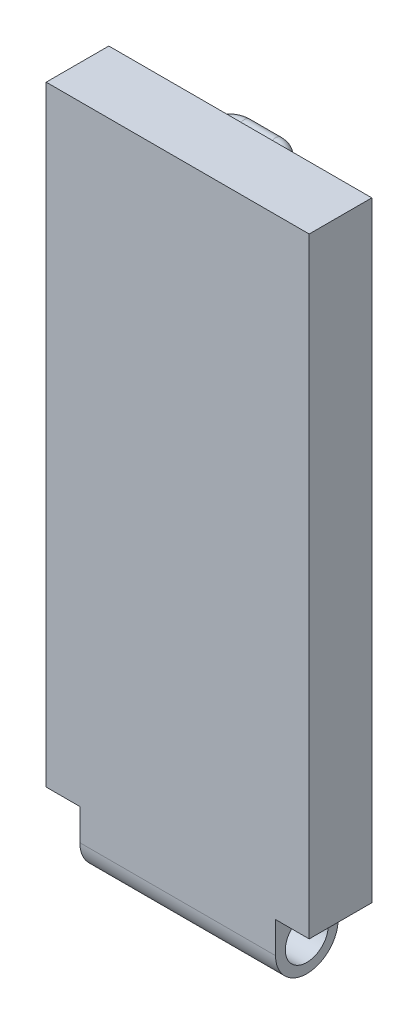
ISO-10303-21;
HEADER;
FILE_DESCRIPTION(('STEP AP214'),'2;1');
FILE_NAME('part.step','',(''),(''),'','','');
FILE_SCHEMA(('AUTOMOTIVE_DESIGN { 1 0 10303 214 1 1 1 1 }'));
ENDSEC;
DATA;
#1=APPLICATION_CONTEXT('core data for automotive mechanical design processes');
#2=APPLICATION_PROTOCOL_DEFINITION('international standard','automotive_design',2000,#1);
#3=PRODUCT_CONTEXT('',#1,'mechanical');
#4=PRODUCT('Part','Part','',(#3));
#5=PRODUCT_RELATED_PRODUCT_CATEGORY('part','',(#4));
#6=PRODUCT_DEFINITION_FORMATION('','',#4);
#7=PRODUCT_DEFINITION_CONTEXT('part definition',#1,'design');
#8=PRODUCT_DEFINITION('design','',#6,#7);
#9=PRODUCT_DEFINITION_SHAPE('','',#8);
#10=(LENGTH_UNIT() NAMED_UNIT(*) SI_UNIT(.MILLI.,.METRE.));
#11=(NAMED_UNIT(*) PLANE_ANGLE_UNIT() SI_UNIT($,.RADIAN.));
#12=(NAMED_UNIT(*) SI_UNIT($,.STERADIAN.) SOLID_ANGLE_UNIT());
#13=UNCERTAINTY_MEASURE_WITH_UNIT(LENGTH_MEASURE(1.E-05),#10,'distance_accuracy_value','');
#14=(GEOMETRIC_REPRESENTATION_CONTEXT(3) GLOBAL_UNCERTAINTY_ASSIGNED_CONTEXT((#13)) GLOBAL_UNIT_ASSIGNED_CONTEXT((#10,
#11,#12)) REPRESENTATION_CONTEXT('',''));
#15=CARTESIAN_POINT('',(0.,0.,0.));
#16=DIRECTION('',(0.,0.,1.));
#17=DIRECTION('',(1.,0.,0.));
#18=AXIS2_PLACEMENT_3D('',#15,#16,#17);
#19=CARTESIAN_POINT('',(0.,0.,-8.));
#20=DIRECTION('',(0.,0.,-1.));
#21=DIRECTION('',(-1.,0.,0.));
#22=AXIS2_PLACEMENT_3D('',#19,#20,#21);
#23=PLANE('',#22);
#24=CARTESIAN_POINT('',(12.8,75.,-8.));
#25=DIRECTION('',(0.,0.,-1.));
#26=DIRECTION('',(-1.,0.,0.));
#27=AXIS2_PLACEMENT_3D('',#24,#25,#26);
#28=CIRCLE('',#27,1.);
#29=CARTESIAN_POINT('',(11.8,75.,-8.));
#30=VERTEX_POINT('',#29);
#31=CARTESIAN_POINT('',(13.8,75.,-8.));
#32=VERTEX_POINT('',#31);
#33=EDGE_CURVE('E60',#30,#32,#28,.T.);
#34=ORIENTED_EDGE('',*,*,#33,.F.);
#35=DIRECTION('',(0.,1.,0.));
#36=VECTOR('',#35,1.);
#37=CARTESIAN_POINT('',(11.8,75.,-8.));
#38=LINE('',#37,#36);
#39=CARTESIAN_POINT('',(11.8,73.,-8.));
#40=VERTEX_POINT('',#39);
#41=EDGE_CURVE('E197',#40,#30,#38,.T.);
#42=ORIENTED_EDGE('',*,*,#41,.F.);
#43=CARTESIAN_POINT('',(12.8,73.,-8.));
#44=DIRECTION('',(0.,0.,-1.));
#45=DIRECTION('',(-1.,0.,0.));
#46=AXIS2_PLACEMENT_3D('',#43,#44,#45);
#47=CIRCLE('',#46,1.);
#48=CARTESIAN_POINT('',(13.8,73.,-8.));
#49=VERTEX_POINT('',#48);
#50=EDGE_CURVE('E695',#49,#40,#47,.T.);
#51=ORIENTED_EDGE('',*,*,#50,.F.);
#52=DIRECTION('',(0.,-1.,0.));
#53=VECTOR('',#52,1.);
#54=CARTESIAN_POINT('',(13.8,75.,-8.));
#55=LINE('',#54,#53);
#56=EDGE_CURVE('E702',#32,#49,#55,.T.);
#57=ORIENTED_EDGE('',*,*,#56,.F.);
#58=EDGE_LOOP('',(#34,#42,#51,#57));
#59=FACE_BOUND('',#58,.T.);
#60=DIRECTION('',(0.,-1.,0.));
#61=VECTOR('',#60,1.);
#62=CARTESIAN_POINT('',(0.,0.,-8.));
#63=LINE('',#62,#61);
#64=CARTESIAN_POINT('',(0.,78.,-8.));
#65=VERTEX_POINT('',#64);
#66=CARTESIAN_POINT('',(0.,0.,-8.));
#67=VERTEX_POINT('',#66);
#68=EDGE_CURVE('E344',#65,#67,#63,.T.);
#69=ORIENTED_EDGE('',*,*,#68,.F.);
#70=DIRECTION('',(-1.,0.,0.));
#71=VECTOR('',#70,1.);
#72=CARTESIAN_POINT('',(0.,78.,-8.));
#73=LINE('',#72,#71);
#74=CARTESIAN_POINT('',(33.6,78.,-8.));
#75=VERTEX_POINT('',#74);
#76=EDGE_CURVE('E372',#75,#65,#73,.T.);
#77=ORIENTED_EDGE('',*,*,#76,.F.);
#78=DIRECTION('',(0.,1.,0.));
#79=VECTOR('',#78,1.);
#80=CARTESIAN_POINT('',(33.6,0.,-8.));
#81=LINE('',#80,#79);
#82=CARTESIAN_POINT('',(33.6,0.,-8.));
#83=VERTEX_POINT('',#82);
#84=EDGE_CURVE('E349',#83,#75,#81,.T.);
#85=ORIENTED_EDGE('',*,*,#84,.F.);
#86=DIRECTION('',(1.,0.,0.));
#87=VECTOR('',#86,1.);
#88=CARTESIAN_POINT('',(0.,0.,-8.));
#89=LINE('',#88,#87);
#90=CARTESIAN_POINT('',(29.3,0.,-8.));
#91=VERTEX_POINT('',#90);
#92=EDGE_CURVE('E319',#91,#83,#89,.T.);
#93=ORIENTED_EDGE('',*,*,#92,.F.);
#94=DIRECTION('',(0.,-1.,0.));
#95=VECTOR('',#94,1.);
#96=CARTESIAN_POINT('',(29.3,0.,-8.));
#97=LINE('',#96,#95);
#98=CARTESIAN_POINT('',(29.3,-4.,-8.));
#99=VERTEX_POINT('',#98);
#100=EDGE_CURVE('E302',#91,#99,#97,.T.);
#101=ORIENTED_EDGE('',*,*,#100,.T.);
#102=DIRECTION('',(1.,0.,0.));
#103=VECTOR('',#102,1.);
#104=CARTESIAN_POINT('',(4.3,-4.,-8.));
#105=LINE('',#104,#103);
#106=CARTESIAN_POINT('',(4.3,-4.,-8.));
#107=VERTEX_POINT('',#106);
#108=EDGE_CURVE('E340',#107,#99,#105,.T.);
#109=ORIENTED_EDGE('',*,*,#108,.F.);
#110=DIRECTION('',(0.,-1.,0.));
#111=VECTOR('',#110,1.);
#112=CARTESIAN_POINT('',(4.3,0.,-8.));
#113=LINE('',#112,#111);
#114=CARTESIAN_POINT('',(4.3,0.,-8.));
#115=VERTEX_POINT('',#114);
#116=EDGE_CURVE('E308',#115,#107,#113,.T.);
#117=ORIENTED_EDGE('',*,*,#116,.F.);
#118=EDGE_CURVE('E352',#67,#115,#89,.T.);
#119=ORIENTED_EDGE('',*,*,#118,.F.);
#120=EDGE_LOOP('',(#69,#77,#85,#93,#101,#109,#117,#119));
#121=FACE_BOUND('',#120,.T.);
#122=DIRECTION('',(0.,1.,0.));
#123=VECTOR('',#122,1.);
#124=CARTESIAN_POINT('',(21.8,75.,-8.));
#125=LINE('',#124,#123);
#126=CARTESIAN_POINT('',(21.8,73.,-8.));
#127=VERTEX_POINT('',#126);
#128=CARTESIAN_POINT('',(21.8,75.,-8.));
#129=VERTEX_POINT('',#128);
#130=EDGE_CURVE('E279',#127,#129,#125,.T.);
#131=ORIENTED_EDGE('',*,*,#130,.T.);
#132=CARTESIAN_POINT('',(20.8,75.,-8.));
#133=DIRECTION('',(0.,0.,1.));
#134=DIRECTION('',(1.,0.,0.));
#135=AXIS2_PLACEMENT_3D('',#132,#133,#134);
#136=CIRCLE('',#135,1.);
#137=CARTESIAN_POINT('',(19.8,75.,-8.));
#138=VERTEX_POINT('',#137);
#139=EDGE_CURVE('E276',#129,#138,#136,.T.);
#140=ORIENTED_EDGE('',*,*,#139,.T.);
#141=DIRECTION('',(0.,-1.,0.));
#142=VECTOR('',#141,1.);
#143=CARTESIAN_POINT('',(19.8,75.,-8.));
#144=LINE('',#143,#142);
#145=CARTESIAN_POINT('',(19.8,73.,-8.));
#146=VERTEX_POINT('',#145);
#147=EDGE_CURVE('E285',#138,#146,#144,.T.);
#148=ORIENTED_EDGE('',*,*,#147,.T.);
#149=CARTESIAN_POINT('',(20.8,73.,-8.));
#150=DIRECTION('',(0.,0.,1.));
#151=DIRECTION('',(1.,0.,0.));
#152=AXIS2_PLACEMENT_3D('',#149,#150,#151);
#153=CIRCLE('',#152,1.);
#154=EDGE_CURVE('E282',#146,#127,#153,.T.);
#155=ORIENTED_EDGE('',*,*,#154,.T.);
#156=EDGE_LOOP('',(#131,#140,#148,#155));
#157=FACE_BOUND('',#156,.T.);
#158=ADVANCED_FACE('F35',(#59,#121,#157),#23,.T.);
#159=CARTESIAN_POINT('',(0.,0.,-8.));
#160=DIRECTION('',(0.,-1.,0.));
#161=DIRECTION('',(0.,0.,-1.));
#162=AXIS2_PLACEMENT_3D('',#159,#160,#161);
#163=PLANE('',#162);
#164=DIRECTION('',(1.,0.,0.));
#165=VECTOR('',#164,1.);
#166=CARTESIAN_POINT('',(0.,0.,0.));
#167=LINE('',#166,#165);
#168=CARTESIAN_POINT('',(29.3,0.,0.));
#169=VERTEX_POINT('',#168);
#170=CARTESIAN_POINT('',(33.6,0.,0.));
#171=VERTEX_POINT('',#170);
#172=EDGE_CURVE('E354',#169,#171,#167,.T.);
#173=ORIENTED_EDGE('',*,*,#172,.F.);
#174=DIRECTION('',(0.,0.,-1.));
#175=VECTOR('',#174,1.);
#176=CARTESIAN_POINT('',(29.3,0.,-8.));
#177=LINE('',#176,#175);
#178=EDGE_CURVE('E324',#169,#91,#177,.T.);
#179=ORIENTED_EDGE('',*,*,#178,.T.);
#180=ORIENTED_EDGE('',*,*,#92,.T.);
#181=DIRECTION('',(0.,0.,1.));
#182=VECTOR('',#181,1.);
#183=CARTESIAN_POINT('',(33.6,0.,-8.));
#184=LINE('',#183,#182);
#185=EDGE_CURVE('E369',#83,#171,#184,.T.);
#186=ORIENTED_EDGE('',*,*,#185,.T.);
#187=EDGE_LOOP('',(#173,#179,#180,#186));
#188=FACE_BOUND('',#187,.T.);
#189=ADVANCED_FACE('F400',(#188),#163,.T.);
#190=CARTESIAN_POINT('',(0.,0.,-8.));
#191=DIRECTION('',(-1.,0.,0.));
#192=DIRECTION('',(0.,0.,1.));
#193=AXIS2_PLACEMENT_3D('',#190,#191,#192);
#194=PLANE('',#193);
#195=DIRECTION('',(0.,-1.,0.));
#196=VECTOR('',#195,1.);
#197=CARTESIAN_POINT('',(0.,0.,0.));
#198=LINE('',#197,#196);
#199=CARTESIAN_POINT('',(0.,78.,0.));
#200=VERTEX_POINT('',#199);
#201=CARTESIAN_POINT('',(0.,0.,0.));
#202=VERTEX_POINT('',#201);
#203=EDGE_CURVE('E343',#200,#202,#198,.T.);
#204=ORIENTED_EDGE('',*,*,#203,.F.);
#205=DIRECTION('',(0.,0.,1.));
#206=VECTOR('',#205,1.);
#207=CARTESIAN_POINT('',(0.,78.,-8.));
#208=LINE('',#207,#206);
#209=EDGE_CURVE('E11',#65,#200,#208,.T.);
#210=ORIENTED_EDGE('',*,*,#209,.F.);
#211=ORIENTED_EDGE('',*,*,#68,.T.);
#212=DIRECTION('',(0.,0.,1.));
#213=VECTOR('',#212,1.);
#214=CARTESIAN_POINT('',(0.,0.,-8.));
#215=LINE('',#214,#213);
#216=EDGE_CURVE('E371',#67,#202,#215,.T.);
#217=ORIENTED_EDGE('',*,*,#216,.T.);
#218=EDGE_LOOP('',(#204,#210,#211,#217));
#219=FACE_BOUND('',#218,.T.);
#220=ADVANCED_FACE('F37',(#219),#194,.T.);
#221=CARTESIAN_POINT('',(0.,78.,-8.));
#222=DIRECTION('',(0.,1.,0.));
#223=DIRECTION('',(0.,0.,1.));
#224=AXIS2_PLACEMENT_3D('',#221,#222,#223);
#225=PLANE('',#224);
#226=DIRECTION('',(-1.,0.,0.));
#227=VECTOR('',#226,1.);
#228=CARTESIAN_POINT('',(0.,78.,0.));
#229=LINE('',#228,#227);
#230=CARTESIAN_POINT('',(33.6,78.,0.));
#231=VERTEX_POINT('',#230);
#232=EDGE_CURVE('E346',#231,#200,#229,.T.);
#233=ORIENTED_EDGE('',*,*,#232,.F.);
#234=DIRECTION('',(0.,0.,1.));
#235=VECTOR('',#234,1.);
#236=CARTESIAN_POINT('',(33.6,78.,-8.));
#237=LINE('',#236,#235);
#238=EDGE_CURVE('E44',#75,#231,#237,.T.);
#239=ORIENTED_EDGE('',*,*,#238,.F.);
#240=ORIENTED_EDGE('',*,*,#76,.T.);
#241=ORIENTED_EDGE('',*,*,#209,.T.);
#242=EDGE_LOOP('',(#233,#239,#240,#241));
#243=FACE_BOUND('',#242,.T.);
#244=ADVANCED_FACE('F393',(#243),#225,.T.);
#245=CARTESIAN_POINT('',(33.6,0.,-8.));
#246=DIRECTION('',(1.,0.,0.));
#247=DIRECTION('',(0.,0.,-1.));
#248=AXIS2_PLACEMENT_3D('',#245,#246,#247);
#249=PLANE('',#248);
#250=DIRECTION('',(0.,1.,0.));
#251=VECTOR('',#250,1.);
#252=CARTESIAN_POINT('',(33.6,0.,0.));
#253=LINE('',#252,#251);
#254=EDGE_CURVE('E362',#171,#231,#253,.T.);
#255=ORIENTED_EDGE('',*,*,#254,.F.);
#256=ORIENTED_EDGE('',*,*,#185,.F.);
#257=ORIENTED_EDGE('',*,*,#84,.T.);
#258=ORIENTED_EDGE('',*,*,#238,.T.);
#259=EDGE_LOOP('',(#255,#256,#257,#258));
#260=FACE_BOUND('',#259,.T.);
#261=ADVANCED_FACE('F384',(#260),#249,.T.);
#262=DIRECTION('',(0.,0.,-1.));
#263=VECTOR('',#262,1.);
#264=CARTESIAN_POINT('',(4.3,0.,-8.));
#265=LINE('',#264,#263);
#266=CARTESIAN_POINT('',(4.3,0.,0.));
#267=VERTEX_POINT('',#266);
#268=EDGE_CURVE('E314',#267,#115,#265,.T.);
#269=ORIENTED_EDGE('',*,*,#268,.F.);
#270=EDGE_CURVE('E357',#202,#267,#167,.T.);
#271=ORIENTED_EDGE('',*,*,#270,.F.);
#272=ORIENTED_EDGE('',*,*,#216,.F.);
#273=ORIENTED_EDGE('',*,*,#118,.T.);
#274=EDGE_LOOP('',(#269,#271,#272,#273));
#275=FACE_BOUND('',#274,.T.);
#276=ADVANCED_FACE('F415',(#275),#163,.T.);
#277=CARTESIAN_POINT('',(0.,0.,0.));
#278=DIRECTION('',(0.,0.,-1.));
#279=DIRECTION('',(-1.,0.,0.));
#280=AXIS2_PLACEMENT_3D('',#277,#278,#279);
#281=PLANE('',#280);
#282=ORIENTED_EDGE('',*,*,#203,.T.);
#283=ORIENTED_EDGE('',*,*,#270,.T.);
#284=DIRECTION('',(0.,1.,0.));
#285=VECTOR('',#284,1.);
#286=CARTESIAN_POINT('',(4.3,0.,0.));
#287=LINE('',#286,#285);
#288=CARTESIAN_POINT('',(4.3,-4.,0.));
#289=VERTEX_POINT('',#288);
#290=EDGE_CURVE('E307',#289,#267,#287,.T.);
#291=ORIENTED_EDGE('',*,*,#290,.F.);
#292=DIRECTION('',(1.,0.,0.));
#293=VECTOR('',#292,1.);
#294=CARTESIAN_POINT('',(4.3,-4.,0.));
#295=LINE('',#294,#293);
#296=CARTESIAN_POINT('',(29.3,-4.,0.));
#297=VERTEX_POINT('',#296);
#298=EDGE_CURVE('E318',#289,#297,#295,.T.);
#299=ORIENTED_EDGE('',*,*,#298,.T.);
#300=DIRECTION('',(0.,1.,0.));
#301=VECTOR('',#300,1.);
#302=CARTESIAN_POINT('',(29.3,0.,0.));
#303=LINE('',#302,#301);
#304=EDGE_CURVE('E331',#297,#169,#303,.T.);
#305=ORIENTED_EDGE('',*,*,#304,.T.);
#306=ORIENTED_EDGE('',*,*,#172,.T.);
#307=ORIENTED_EDGE('',*,*,#254,.T.);
#308=ORIENTED_EDGE('',*,*,#232,.T.);
#309=EDGE_LOOP('',(#282,#283,#291,#299,#305,#306,#307,#308));
#310=FACE_BOUND('',#309,.T.);
#311=ADVANCED_FACE('F395',(#310),#281,.F.);
#312=CARTESIAN_POINT('',(4.3,-4.,-4.));
#313=DIRECTION('',(-1.,0.,0.));
#314=DIRECTION('',(0.,0.,1.));
#315=AXIS2_PLACEMENT_3D('',#312,#313,#314);
#316=PLANE('',#315);
#317=ORIENTED_EDGE('',*,*,#116,.T.);
#318=CARTESIAN_POINT('',(4.3,-4.,-4.));
#319=DIRECTION('',(-1.,0.,0.));
#320=DIRECTION('',(0.,0.,1.));
#321=AXIS2_PLACEMENT_3D('',#318,#319,#320);
#322=CIRCLE('',#321,4.);
#323=EDGE_CURVE('E305',#107,#289,#322,.T.);
#324=ORIENTED_EDGE('',*,*,#323,.T.);
#325=ORIENTED_EDGE('',*,*,#290,.T.);
#326=ORIENTED_EDGE('',*,*,#268,.T.);
#327=EDGE_LOOP('',(#317,#324,#325,#326));
#328=FACE_BOUND('',#327,.T.);
#329=CARTESIAN_POINT('',(4.3,-4.,-4.));
#330=DIRECTION('',(-1.,0.,0.));
#331=DIRECTION('',(0.,0.,1.));
#332=AXIS2_PLACEMENT_3D('',#329,#330,#331);
#333=CIRCLE('',#332,2.75);
#334=CARTESIAN_POINT('',(4.3,-4.,-1.25));
#335=VERTEX_POINT('',#334);
#336=EDGE_CURVE('E299',#335,#335,#333,.T.);
#337=ORIENTED_EDGE('',*,*,#336,.F.);
#338=EDGE_LOOP('',(#337));
#339=FACE_BOUND('',#338,.T.);
#340=ADVANCED_FACE('F412',(#328,#339),#316,.T.);
#341=CARTESIAN_POINT('',(29.3,-4.,-4.));
#342=DIRECTION('',(-1.,0.,0.));
#343=DIRECTION('',(0.,0.,1.));
#344=AXIS2_PLACEMENT_3D('',#341,#342,#343);
#345=PLANE('',#344);
#346=ORIENTED_EDGE('',*,*,#100,.F.);
#347=ORIENTED_EDGE('',*,*,#178,.F.);
#348=ORIENTED_EDGE('',*,*,#304,.F.);
#349=CARTESIAN_POINT('',(29.3,-4.,-4.));
#350=DIRECTION('',(-1.,0.,0.));
#351=DIRECTION('',(0.,0.,1.));
#352=AXIS2_PLACEMENT_3D('',#349,#350,#351);
#353=CIRCLE('',#352,4.);
#354=EDGE_CURVE('E311',#99,#297,#353,.T.);
#355=ORIENTED_EDGE('',*,*,#354,.F.);
#356=EDGE_LOOP('',(#346,#347,#348,#355));
#357=FACE_BOUND('',#356,.T.);
#358=CARTESIAN_POINT('',(29.3,-4.,-4.));
#359=DIRECTION('',(-1.,0.,0.));
#360=DIRECTION('',(0.,0.,1.));
#361=AXIS2_PLACEMENT_3D('',#358,#359,#360);
#362=CIRCLE('',#361,2.75);
#363=CARTESIAN_POINT('',(29.3,-4.,-1.25));
#364=VERTEX_POINT('',#363);
#365=EDGE_CURVE('E298',#364,#364,#362,.T.);
#366=ORIENTED_EDGE('',*,*,#365,.T.);
#367=EDGE_LOOP('',(#366));
#368=FACE_BOUND('',#367,.T.);
#369=ADVANCED_FACE('F405',(#357,#368),#345,.F.);
#370=CARTESIAN_POINT('',(4.3,-4.,-4.));
#371=DIRECTION('',(1.,0.,0.));
#372=DIRECTION('',(0.,0.,-1.));
#373=AXIS2_PLACEMENT_3D('',#370,#371,#372);
#374=CYLINDRICAL_SURFACE('',#373,4.);
#375=ORIENTED_EDGE('',*,*,#354,.T.);
#376=ORIENTED_EDGE('',*,*,#298,.F.);
#377=ORIENTED_EDGE('',*,*,#323,.F.);
#378=ORIENTED_EDGE('',*,*,#108,.T.);
#379=EDGE_LOOP('',(#375,#376,#377,#378));
#380=FACE_BOUND('',#379,.T.);
#381=ADVANCED_FACE('F409',(#380),#374,.T.);
#382=CARTESIAN_POINT('',(4.3,-4.,-4.));
#383=DIRECTION('',(1.,0.,0.));
#384=DIRECTION('',(0.,0.,-1.));
#385=AXIS2_PLACEMENT_3D('',#382,#383,#384);
#386=CYLINDRICAL_SURFACE('',#385,2.75);
#387=ORIENTED_EDGE('',*,*,#336,.T.);
#388=EDGE_LOOP('',(#387));
#389=FACE_BOUND('',#388,.T.);
#390=ORIENTED_EDGE('',*,*,#365,.F.);
#391=EDGE_LOOP('',(#390));
#392=FACE_BOUND('',#391,.T.);
#393=ADVANCED_FACE('F480',(#389,#392),#386,.F.);
#394=CARTESIAN_POINT('',(19.8,75.,-8.5));
#395=DIRECTION('',(-1.,0.,0.));
#396=DIRECTION('',(0.,0.,1.));
#397=AXIS2_PLACEMENT_3D('',#394,#395,#396);
#398=PLANE('',#397);
#399=DIRECTION('',(0.,-1.,0.));
#400=VECTOR('',#399,1.);
#401=CARTESIAN_POINT('',(19.8,75.,-8.5));
#402=LINE('',#401,#400);
#403=CARTESIAN_POINT('',(19.8,75.,-8.5));
#404=VERTEX_POINT('',#403);
#405=CARTESIAN_POINT('',(19.8,73.,-8.5));
#406=VERTEX_POINT('',#405);
#407=EDGE_CURVE('E261',#404,#406,#402,.T.);
#408=ORIENTED_EDGE('',*,*,#407,.T.);
#409=DIRECTION('',(0.,0.,1.));
#410=VECTOR('',#409,1.);
#411=CARTESIAN_POINT('',(19.8,73.,-8.5));
#412=LINE('',#411,#410);
#413=EDGE_CURVE('E292',#406,#146,#412,.T.);
#414=ORIENTED_EDGE('',*,*,#413,.T.);
#415=ORIENTED_EDGE('',*,*,#147,.F.);
#416=DIRECTION('',(0.,0.,1.));
#417=VECTOR('',#416,1.);
#418=CARTESIAN_POINT('',(19.8,75.,-8.5));
#419=LINE('',#418,#417);
#420=EDGE_CURVE('E295',#404,#138,#419,.T.);
#421=ORIENTED_EDGE('',*,*,#420,.F.);
#422=EDGE_LOOP('',(#408,#414,#415,#421));
#423=FACE_BOUND('',#422,.T.);
#424=ADVANCED_FACE('F487',(#423),#398,.T.);
#425=CARTESIAN_POINT('',(20.8,73.,-8.5));
#426=DIRECTION('',(0.,0.,1.));
#427=DIRECTION('',(1.,0.,0.));
#428=AXIS2_PLACEMENT_3D('',#425,#426,#427);
#429=CYLINDRICAL_SURFACE('',#428,1.);
#430=CARTESIAN_POINT('',(20.8,73.,-8.5));
#431=DIRECTION('',(0.,0.,1.));
#432=DIRECTION('',(1.,0.,0.));
#433=AXIS2_PLACEMENT_3D('',#430,#431,#432);
#434=CIRCLE('',#433,1.);
#435=CARTESIAN_POINT('',(21.8,73.,-8.5));
#436=VERTEX_POINT('',#435);
#437=EDGE_CURVE('E258',#406,#436,#434,.T.);
#438=ORIENTED_EDGE('',*,*,#437,.T.);
#439=DIRECTION('',(0.,0.,1.));
#440=VECTOR('',#439,1.);
#441=CARTESIAN_POINT('',(21.8,73.,-8.5));
#442=LINE('',#441,#440);
#443=EDGE_CURVE('E289',#436,#127,#442,.T.);
#444=ORIENTED_EDGE('',*,*,#443,.T.);
#445=ORIENTED_EDGE('',*,*,#154,.F.);
#446=ORIENTED_EDGE('',*,*,#413,.F.);
#447=EDGE_LOOP('',(#438,#444,#445,#446));
#448=FACE_BOUND('',#447,.T.);
#449=ADVANCED_FACE('F501',(#448),#429,.T.);
#450=CARTESIAN_POINT('',(21.8,75.,-8.5));
#451=DIRECTION('',(1.,0.,0.));
#452=DIRECTION('',(0.,0.,-1.));
#453=AXIS2_PLACEMENT_3D('',#450,#451,#452);
#454=PLANE('',#453);
#455=DIRECTION('',(0.,1.,0.));
#456=VECTOR('',#455,1.);
#457=CARTESIAN_POINT('',(21.8,75.,-8.5));
#458=LINE('',#457,#456);
#459=CARTESIAN_POINT('',(21.8,75.,-8.5));
#460=VERTEX_POINT('',#459);
#461=EDGE_CURVE('E256',#436,#460,#458,.T.);
#462=ORIENTED_EDGE('',*,*,#461,.T.);
#463=DIRECTION('',(0.,0.,1.));
#464=VECTOR('',#463,1.);
#465=CARTESIAN_POINT('',(21.8,75.,-8.5));
#466=LINE('',#465,#464);
#467=EDGE_CURVE('E52',#460,#129,#466,.T.);
#468=ORIENTED_EDGE('',*,*,#467,.T.);
#469=ORIENTED_EDGE('',*,*,#130,.F.);
#470=ORIENTED_EDGE('',*,*,#443,.F.);
#471=EDGE_LOOP('',(#462,#468,#469,#470));
#472=FACE_BOUND('',#471,.T.);
#473=ADVANCED_FACE('F509',(#472),#454,.T.);
#474=CARTESIAN_POINT('',(20.8,75.,-8.5));
#475=DIRECTION('',(0.,0.,1.));
#476=DIRECTION('',(1.,0.,0.));
#477=AXIS2_PLACEMENT_3D('',#474,#475,#476);
#478=CYLINDRICAL_SURFACE('',#477,1.);
#479=CARTESIAN_POINT('',(20.8,75.,-8.5));
#480=DIRECTION('',(0.,0.,1.));
#481=DIRECTION('',(1.,0.,0.));
#482=AXIS2_PLACEMENT_3D('',#479,#480,#481);
#483=CIRCLE('',#482,1.);
#484=EDGE_CURVE('E253',#460,#404,#483,.T.);
#485=ORIENTED_EDGE('',*,*,#484,.T.);
#486=ORIENTED_EDGE('',*,*,#420,.T.);
#487=ORIENTED_EDGE('',*,*,#139,.F.);
#488=ORIENTED_EDGE('',*,*,#467,.F.);
#489=EDGE_LOOP('',(#485,#486,#487,#488));
#490=FACE_BOUND('',#489,.T.);
#491=ADVANCED_FACE('F517',(#490),#478,.T.);
#492=CARTESIAN_POINT('',(18.8,74.,-8.5));
#493=DIRECTION('',(0.,-1.,0.));
#494=DIRECTION('',(0.,0.,-1.));
#495=AXIS2_PLACEMENT_3D('',#492,#493,#494);
#496=CYLINDRICAL_SURFACE('',#495,1.);
#497=DIRECTION('',(0.,-1.,0.));
#498=VECTOR('',#497,1.);
#499=CARTESIAN_POINT('',(18.8,75.,-9.5));
#500=LINE('',#499,#498);
#501=CARTESIAN_POINT('',(18.8,75.,-9.5));
#502=VERTEX_POINT('',#501);
#503=CARTESIAN_POINT('',(18.8,73.,-9.5));
#504=VERTEX_POINT('',#503);
#505=EDGE_CURVE('E238',#502,#504,#500,.T.);
#506=ORIENTED_EDGE('',*,*,#505,.T.);
#507=CARTESIAN_POINT('',(18.8,73.,-8.5));
#508=DIRECTION('',(0.,-1.,0.));
#509=DIRECTION('',(0.,0.,-1.));
#510=AXIS2_PLACEMENT_3D('',#507,#508,#509);
#511=CIRCLE('',#510,1.);
#512=EDGE_CURVE('E270',#504,#406,#511,.T.);
#513=ORIENTED_EDGE('',*,*,#512,.T.);
#514=ORIENTED_EDGE('',*,*,#407,.F.);
#515=CARTESIAN_POINT('',(18.8,75.,-8.5));
#516=DIRECTION('',(0.,-1.,0.));
#517=DIRECTION('',(0.,0.,-1.));
#518=AXIS2_PLACEMENT_3D('',#515,#516,#517);
#519=CIRCLE('',#518,1.);
#520=EDGE_CURVE('E273',#502,#404,#519,.T.);
#521=ORIENTED_EDGE('',*,*,#520,.F.);
#522=EDGE_LOOP('',(#506,#513,#514,#521));
#523=FACE_BOUND('',#522,.T.);
#524=ADVANCED_FACE('F524',(#523),#496,.F.);
#525=CARTESIAN_POINT('',(18.8,73.,-8.5));
#526=DIRECTION('',(0.,-1.,0.));
#527=DIRECTION('',(0.,0.,-1.));
#528=AXIS2_PLACEMENT_3D('',#525,#526,#527);
#529=TOROIDAL_SURFACE('',#528,2.,1.);
#530=CARTESIAN_POINT('',(18.8,73.,-10.5));
#531=DIRECTION('',(1.,0.,0.));
#532=DIRECTION('',(0.,0.,-1.));
#533=AXIS2_PLACEMENT_3D('',#530,#531,#532);
#534=CIRCLE('',#533,1.);
#535=CARTESIAN_POINT('',(18.8,73.,-11.5));
#536=VERTEX_POINT('',#535);
#537=EDGE_CURVE('E235',#504,#536,#534,.T.);
#538=ORIENTED_EDGE('',*,*,#537,.T.);
#539=CARTESIAN_POINT('',(18.8,73.,-8.5));
#540=DIRECTION('',(0.,-1.,0.));
#541=DIRECTION('',(0.,0.,-1.));
#542=AXIS2_PLACEMENT_3D('',#539,#540,#541);
#543=CIRCLE('',#542,3.);
#544=EDGE_CURVE('E267',#536,#436,#543,.T.);
#545=ORIENTED_EDGE('',*,*,#544,.T.);
#546=ORIENTED_EDGE('',*,*,#437,.F.);
#547=ORIENTED_EDGE('',*,*,#512,.F.);
#548=EDGE_LOOP('',(#538,#545,#546,#547));
#549=FACE_BOUND('',#548,.T.);
#550=ADVANCED_FACE('F532',(#549),#529,.T.);
#551=CARTESIAN_POINT('',(18.8,74.,-8.5));
#552=DIRECTION('',(0.,-1.,0.));
#553=DIRECTION('',(0.,0.,-1.));
#554=AXIS2_PLACEMENT_3D('',#551,#552,#553);
#555=CYLINDRICAL_SURFACE('',#554,3.);
#556=DIRECTION('',(0.,1.,0.));
#557=VECTOR('',#556,1.);
#558=CARTESIAN_POINT('',(18.8,75.,-11.5));
#559=LINE('',#558,#557);
#560=CARTESIAN_POINT('',(18.8,75.,-11.5));
#561=VERTEX_POINT('',#560);
#562=EDGE_CURVE('E232',#536,#561,#559,.T.);
#563=ORIENTED_EDGE('',*,*,#562,.T.);
#564=CARTESIAN_POINT('',(18.8,75.,-8.5));
#565=DIRECTION('',(0.,-1.,0.));
#566=DIRECTION('',(0.,0.,-1.));
#567=AXIS2_PLACEMENT_3D('',#564,#565,#566);
#568=CIRCLE('',#567,3.);
#569=EDGE_CURVE('E264',#561,#460,#568,.T.);
#570=ORIENTED_EDGE('',*,*,#569,.T.);
#571=ORIENTED_EDGE('',*,*,#461,.F.);
#572=ORIENTED_EDGE('',*,*,#544,.F.);
#573=EDGE_LOOP('',(#563,#570,#571,#572));
#574=FACE_BOUND('',#573,.T.);
#575=ADVANCED_FACE('F540',(#574),#555,.T.);
#576=CARTESIAN_POINT('',(18.8,75.,-8.5));
#577=DIRECTION('',(0.,-1.,0.));
#578=DIRECTION('',(0.,0.,-1.));
#579=AXIS2_PLACEMENT_3D('',#576,#577,#578);
#580=TOROIDAL_SURFACE('',#579,2.,1.);
#581=CARTESIAN_POINT('',(18.8,75.,-10.5));
#582=DIRECTION('',(1.,0.,0.));
#583=DIRECTION('',(0.,0.,-1.));
#584=AXIS2_PLACEMENT_3D('',#581,#582,#583);
#585=CIRCLE('',#584,1.);
#586=EDGE_CURVE('E185',#561,#502,#585,.T.);
#587=ORIENTED_EDGE('',*,*,#586,.T.);
#588=ORIENTED_EDGE('',*,*,#520,.T.);
#589=ORIENTED_EDGE('',*,*,#484,.F.);
#590=ORIENTED_EDGE('',*,*,#569,.F.);
#591=EDGE_LOOP('',(#587,#588,#589,#590));
#592=FACE_BOUND('',#591,.T.);
#593=ADVANCED_FACE('F548',(#592),#580,.T.);
#594=CARTESIAN_POINT('',(14.8,75.,-9.5));
#595=DIRECTION('',(0.,0.,1.));
#596=DIRECTION('',(1.,0.,0.));
#597=AXIS2_PLACEMENT_3D('',#594,#595,#596);
#598=PLANE('',#597);
#599=DIRECTION('',(0.,-1.,0.));
#600=VECTOR('',#599,1.);
#601=CARTESIAN_POINT('',(14.8,75.,-9.5));
#602=LINE('',#601,#600);
#603=CARTESIAN_POINT('',(14.8,75.,-9.5));
#604=VERTEX_POINT('',#603);
#605=CARTESIAN_POINT('',(14.8,73.,-9.5));
#606=VERTEX_POINT('',#605);
#607=EDGE_CURVE('E182',#604,#606,#602,.T.);
#608=ORIENTED_EDGE('',*,*,#607,.T.);
#609=DIRECTION('',(1.,0.,0.));
#610=VECTOR('',#609,1.);
#611=CARTESIAN_POINT('',(14.8,73.,-9.5));
#612=LINE('',#611,#610);
#613=EDGE_CURVE('E247',#606,#504,#612,.T.);
#614=ORIENTED_EDGE('',*,*,#613,.T.);
#615=ORIENTED_EDGE('',*,*,#505,.F.);
#616=DIRECTION('',(1.,0.,0.));
#617=VECTOR('',#616,1.);
#618=CARTESIAN_POINT('',(14.8,75.,-9.5));
#619=LINE('',#618,#617);
#620=EDGE_CURVE('E250',#604,#502,#619,.T.);
#621=ORIENTED_EDGE('',*,*,#620,.F.);
#622=EDGE_LOOP('',(#608,#614,#615,#621));
#623=FACE_BOUND('',#622,.T.);
#624=ADVANCED_FACE('F556',(#623),#598,.T.);
#625=CARTESIAN_POINT('',(14.8,73.,-10.5));
#626=DIRECTION('',(1.,0.,0.));
#627=DIRECTION('',(0.,0.,-1.));
#628=AXIS2_PLACEMENT_3D('',#625,#626,#627);
#629=CYLINDRICAL_SURFACE('',#628,1.);
#630=CARTESIAN_POINT('',(14.8,73.,-10.5));
#631=DIRECTION('',(1.,0.,0.));
#632=DIRECTION('',(0.,0.,-1.));
#633=AXIS2_PLACEMENT_3D('',#630,#631,#632);
#634=CIRCLE('',#633,1.);
#635=CARTESIAN_POINT('',(14.8,73.,-11.5));
#636=VERTEX_POINT('',#635);
#637=EDGE_CURVE('E221',#606,#636,#634,.T.);
#638=ORIENTED_EDGE('',*,*,#637,.T.);
#639=DIRECTION('',(1.,0.,0.));
#640=VECTOR('',#639,1.);
#641=CARTESIAN_POINT('',(14.8,73.,-11.5));
#642=LINE('',#641,#640);
#643=EDGE_CURVE('E244',#636,#536,#642,.T.);
#644=ORIENTED_EDGE('',*,*,#643,.T.);
#645=ORIENTED_EDGE('',*,*,#537,.F.);
#646=ORIENTED_EDGE('',*,*,#613,.F.);
#647=EDGE_LOOP('',(#638,#644,#645,#646));
#648=FACE_BOUND('',#647,.T.);
#649=ADVANCED_FACE('F564',(#648),#629,.T.);
#650=CARTESIAN_POINT('',(14.8,75.,-11.5));
#651=DIRECTION('',(0.,0.,-1.));
#652=DIRECTION('',(-1.,0.,0.));
#653=AXIS2_PLACEMENT_3D('',#650,#651,#652);
#654=PLANE('',#653);
#655=DIRECTION('',(0.,1.,0.));
#656=VECTOR('',#655,1.);
#657=CARTESIAN_POINT('',(14.8,75.,-11.5));
#658=LINE('',#657,#656);
#659=CARTESIAN_POINT('',(14.8,75.,-11.5));
#660=VERTEX_POINT('',#659);
#661=EDGE_CURVE('E213',#636,#660,#658,.T.);
#662=ORIENTED_EDGE('',*,*,#661,.T.);
#663=DIRECTION('',(1.,0.,0.));
#664=VECTOR('',#663,1.);
#665=CARTESIAN_POINT('',(14.8,75.,-11.5));
#666=LINE('',#665,#664);
#667=EDGE_CURVE('E241',#660,#561,#666,.T.);
#668=ORIENTED_EDGE('',*,*,#667,.T.);
#669=ORIENTED_EDGE('',*,*,#562,.F.);
#670=ORIENTED_EDGE('',*,*,#643,.F.);
#671=EDGE_LOOP('',(#662,#668,#669,#670));
#672=FACE_BOUND('',#671,.T.);
#673=ADVANCED_FACE('F572',(#672),#654,.T.);
#674=CARTESIAN_POINT('',(14.8,75.,-10.5));
#675=DIRECTION('',(1.,0.,0.));
#676=DIRECTION('',(0.,0.,-1.));
#677=AXIS2_PLACEMENT_3D('',#674,#675,#676);
#678=CYLINDRICAL_SURFACE('',#677,1.);
#679=CARTESIAN_POINT('',(14.8,75.,-10.5));
#680=DIRECTION('',(1.,0.,0.));
#681=DIRECTION('',(0.,0.,-1.));
#682=AXIS2_PLACEMENT_3D('',#679,#680,#681);
#683=CIRCLE('',#682,1.);
#684=EDGE_CURVE('E210',#660,#604,#683,.T.);
#685=ORIENTED_EDGE('',*,*,#684,.T.);
#686=ORIENTED_EDGE('',*,*,#620,.T.);
#687=ORIENTED_EDGE('',*,*,#586,.F.);
#688=ORIENTED_EDGE('',*,*,#667,.F.);
#689=EDGE_LOOP('',(#685,#686,#687,#688));
#690=FACE_BOUND('',#689,.T.);
#691=ADVANCED_FACE('F580',(#690),#678,.T.);
#692=CARTESIAN_POINT('',(14.8,74.,-8.5));
#693=DIRECTION('',(0.,-1.,0.));
#694=DIRECTION('',(0.,0.,-1.));
#695=AXIS2_PLACEMENT_3D('',#692,#693,#694);
#696=CYLINDRICAL_SURFACE('',#695,0.999999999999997);
#697=DIRECTION('',(0.,-1.,0.));
#698=VECTOR('',#697,1.);
#699=CARTESIAN_POINT('',(13.8,75.,-8.5));
#700=LINE('',#699,#698);
#701=CARTESIAN_POINT('',(13.8,75.,-8.5));
#702=VERTEX_POINT('',#701);
#703=CARTESIAN_POINT('',(13.8,73.,-8.5));
#704=VERTEX_POINT('',#703);
#705=EDGE_CURVE('E179',#702,#704,#700,.T.);
#706=ORIENTED_EDGE('',*,*,#705,.T.);
#707=CARTESIAN_POINT('',(14.8,73.,-8.5));
#708=DIRECTION('',(0.,-1.,0.));
#709=DIRECTION('',(0.,0.,-1.));
#710=AXIS2_PLACEMENT_3D('',#707,#708,#709);
#711=CIRCLE('',#710,0.999999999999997);
#712=EDGE_CURVE('E186',#704,#606,#711,.T.);
#713=ORIENTED_EDGE('',*,*,#712,.T.);
#714=ORIENTED_EDGE('',*,*,#607,.F.);
#715=CARTESIAN_POINT('',(14.8,75.,-8.5));
#716=DIRECTION('',(0.,-1.,0.));
#717=DIRECTION('',(0.,0.,-1.));
#718=AXIS2_PLACEMENT_3D('',#715,#716,#717);
#719=CIRCLE('',#718,0.999999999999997);
#720=EDGE_CURVE('E174',#702,#604,#719,.T.);
#721=ORIENTED_EDGE('',*,*,#720,.F.);
#722=EDGE_LOOP('',(#706,#713,#714,#721));
#723=FACE_BOUND('',#722,.T.);
#724=ADVANCED_FACE('F176',(#723),#696,.F.);
#725=CARTESIAN_POINT('',(14.8,73.,-8.5));
#726=DIRECTION('',(0.,-1.,0.));
#727=DIRECTION('',(0.,0.,-1.));
#728=AXIS2_PLACEMENT_3D('',#725,#726,#727);
#729=TOROIDAL_SURFACE('',#728,2.,1.);
#730=CARTESIAN_POINT('',(12.8,73.,-8.5));
#731=DIRECTION('',(0.,0.,-1.));
#732=DIRECTION('',(-1.,0.,0.));
#733=AXIS2_PLACEMENT_3D('',#730,#731,#732);
#734=CIRCLE('',#733,1.);
#735=CARTESIAN_POINT('',(11.8,73.,-8.5));
#736=VERTEX_POINT('',#735);
#737=EDGE_CURVE('E207',#704,#736,#734,.T.);
#738=ORIENTED_EDGE('',*,*,#737,.T.);
#739=CARTESIAN_POINT('',(14.8,73.,-8.5));
#740=DIRECTION('',(0.,-1.,0.));
#741=DIRECTION('',(0.,0.,-1.));
#742=AXIS2_PLACEMENT_3D('',#739,#740,#741);
#743=CIRCLE('',#742,3.);
#744=EDGE_CURVE('E226',#736,#636,#743,.T.);
#745=ORIENTED_EDGE('',*,*,#744,.T.);
#746=ORIENTED_EDGE('',*,*,#637,.F.);
#747=ORIENTED_EDGE('',*,*,#712,.F.);
#748=EDGE_LOOP('',(#738,#745,#746,#747));
#749=FACE_BOUND('',#748,.T.);
#750=ADVANCED_FACE('F595',(#749),#729,.T.);
#751=CARTESIAN_POINT('',(14.8,74.,-8.5));
#752=DIRECTION('',(0.,-1.,0.));
#753=DIRECTION('',(0.,0.,-1.));
#754=AXIS2_PLACEMENT_3D('',#751,#752,#753);
#755=CYLINDRICAL_SURFACE('',#754,3.);
#756=DIRECTION('',(0.,1.,0.));
#757=VECTOR('',#756,1.);
#758=CARTESIAN_POINT('',(11.8,75.,-8.5));
#759=LINE('',#758,#757);
#760=CARTESIAN_POINT('',(11.8,75.,-8.5));
#761=VERTEX_POINT('',#760);
#762=EDGE_CURVE('E697',#736,#761,#759,.T.);
#763=ORIENTED_EDGE('',*,*,#762,.T.);
#764=CARTESIAN_POINT('',(14.8,75.,-8.5));
#765=DIRECTION('',(0.,-1.,0.));
#766=DIRECTION('',(0.,0.,-1.));
#767=AXIS2_PLACEMENT_3D('',#764,#765,#766);
#768=CIRCLE('',#767,3.);
#769=EDGE_CURVE('E192',#761,#660,#768,.T.);
#770=ORIENTED_EDGE('',*,*,#769,.T.);
#771=ORIENTED_EDGE('',*,*,#661,.F.);
#772=ORIENTED_EDGE('',*,*,#744,.F.);
#773=EDGE_LOOP('',(#763,#770,#771,#772));
#774=FACE_BOUND('',#773,.T.);
#775=ADVANCED_FACE('F602',(#774),#755,.T.);
#776=CARTESIAN_POINT('',(14.8,75.,-8.5));
#777=DIRECTION('',(0.,-1.,0.));
#778=DIRECTION('',(0.,0.,-1.));
#779=AXIS2_PLACEMENT_3D('',#776,#777,#778);
#780=TOROIDAL_SURFACE('',#779,2.,1.);
#781=CARTESIAN_POINT('',(12.8,75.,-8.5));
#782=DIRECTION('',(0.,0.,-1.));
#783=DIRECTION('',(-1.,0.,0.));
#784=AXIS2_PLACEMENT_3D('',#781,#782,#783);
#785=CIRCLE('',#784,1.);
#786=EDGE_CURVE('E189',#761,#702,#785,.T.);
#787=ORIENTED_EDGE('',*,*,#786,.T.);
#788=ORIENTED_EDGE('',*,*,#720,.T.);
#789=ORIENTED_EDGE('',*,*,#684,.F.);
#790=ORIENTED_EDGE('',*,*,#769,.F.);
#791=EDGE_LOOP('',(#787,#788,#789,#790));
#792=FACE_BOUND('',#791,.T.);
#793=ADVANCED_FACE('F190',(#792),#780,.T.);
#794=CARTESIAN_POINT('',(12.8,75.,-8.5));
#795=DIRECTION('',(0.,0.,1.));
#796=DIRECTION('',(1.,0.,0.));
#797=AXIS2_PLACEMENT_3D('',#794,#795,#796);
#798=CYLINDRICAL_SURFACE('',#797,1.);
#799=ORIENTED_EDGE('',*,*,#33,.T.);
#800=DIRECTION('',(0.,0.,1.));
#801=VECTOR('',#800,1.);
#802=CARTESIAN_POINT('',(13.8,75.,-8.5));
#803=LINE('',#802,#801);
#804=EDGE_CURVE('E203',#702,#32,#803,.T.);
#805=ORIENTED_EDGE('',*,*,#804,.F.);
#806=ORIENTED_EDGE('',*,*,#786,.F.);
#807=DIRECTION('',(0.,0.,1.));
#808=VECTOR('',#807,1.);
#809=CARTESIAN_POINT('',(11.8,75.,-8.5));
#810=LINE('',#809,#808);
#811=EDGE_CURVE('E692',#761,#30,#810,.T.);
#812=ORIENTED_EDGE('',*,*,#811,.T.);
#813=EDGE_LOOP('',(#799,#805,#806,#812));
#814=FACE_BOUND('',#813,.T.);
#815=ADVANCED_FACE('F209',(#814),#798,.T.);
#816=CARTESIAN_POINT('',(13.8,75.,-8.5));
#817=DIRECTION('',(-1.,0.,0.));
#818=DIRECTION('',(0.,0.,1.));
#819=AXIS2_PLACEMENT_3D('',#816,#817,#818);
#820=PLANE('',#819);
#821=ORIENTED_EDGE('',*,*,#56,.T.);
#822=DIRECTION('',(0.,0.,1.));
#823=VECTOR('',#822,1.);
#824=CARTESIAN_POINT('',(13.8,73.,-8.5));
#825=LINE('',#824,#823);
#826=EDGE_CURVE('E205',#704,#49,#825,.T.);
#827=ORIENTED_EDGE('',*,*,#826,.F.);
#828=ORIENTED_EDGE('',*,*,#705,.F.);
#829=ORIENTED_EDGE('',*,*,#804,.T.);
#830=EDGE_LOOP('',(#821,#827,#828,#829));
#831=FACE_BOUND('',#830,.T.);
#832=ADVANCED_FACE('F202',(#831),#820,.F.);
#833=CARTESIAN_POINT('',(12.8,73.,-8.5));
#834=DIRECTION('',(0.,0.,1.));
#835=DIRECTION('',(1.,0.,0.));
#836=AXIS2_PLACEMENT_3D('',#833,#834,#835);
#837=CYLINDRICAL_SURFACE('',#836,1.);
#838=ORIENTED_EDGE('',*,*,#50,.T.);
#839=DIRECTION('',(0.,0.,1.));
#840=VECTOR('',#839,1.);
#841=CARTESIAN_POINT('',(11.8,73.,-8.5));
#842=LINE('',#841,#840);
#843=EDGE_CURVE('E215',#736,#40,#842,.T.);
#844=ORIENTED_EDGE('',*,*,#843,.F.);
#845=ORIENTED_EDGE('',*,*,#737,.F.);
#846=ORIENTED_EDGE('',*,*,#826,.T.);
#847=EDGE_LOOP('',(#838,#844,#845,#846));
#848=FACE_BOUND('',#847,.T.);
#849=ADVANCED_FACE('F629',(#848),#837,.T.);
#850=CARTESIAN_POINT('',(11.8,75.,-8.5));
#851=DIRECTION('',(1.,0.,0.));
#852=DIRECTION('',(0.,0.,-1.));
#853=AXIS2_PLACEMENT_3D('',#850,#851,#852);
#854=PLANE('',#853);
#855=ORIENTED_EDGE('',*,*,#41,.T.);
#856=ORIENTED_EDGE('',*,*,#811,.F.);
#857=ORIENTED_EDGE('',*,*,#762,.F.);
#858=ORIENTED_EDGE('',*,*,#843,.T.);
#859=EDGE_LOOP('',(#855,#856,#857,#858));
#860=FACE_BOUND('',#859,.T.);
#861=ADVANCED_FACE('F636',(#860),#854,.F.);
#862=CLOSED_SHELL('',(#158,#189,#220,#244,#261,#276,#311,#340,#369,#381,#393,#424,#449,#473,
#491,#524,#550,#575,#593,#624,#649,#673,#691,#724,#750,#775,#793,#815,#832,#849,#861));
#863=MANIFOLD_SOLID_BREP('B2',#862);
#864=ADVANCED_BREP_SHAPE_REPRESENTATION('',(#18,#863),#14);
#865=SHAPE_DEFINITION_REPRESENTATION(#9,#864);
ENDSEC;
END-ISO-10303-21;
